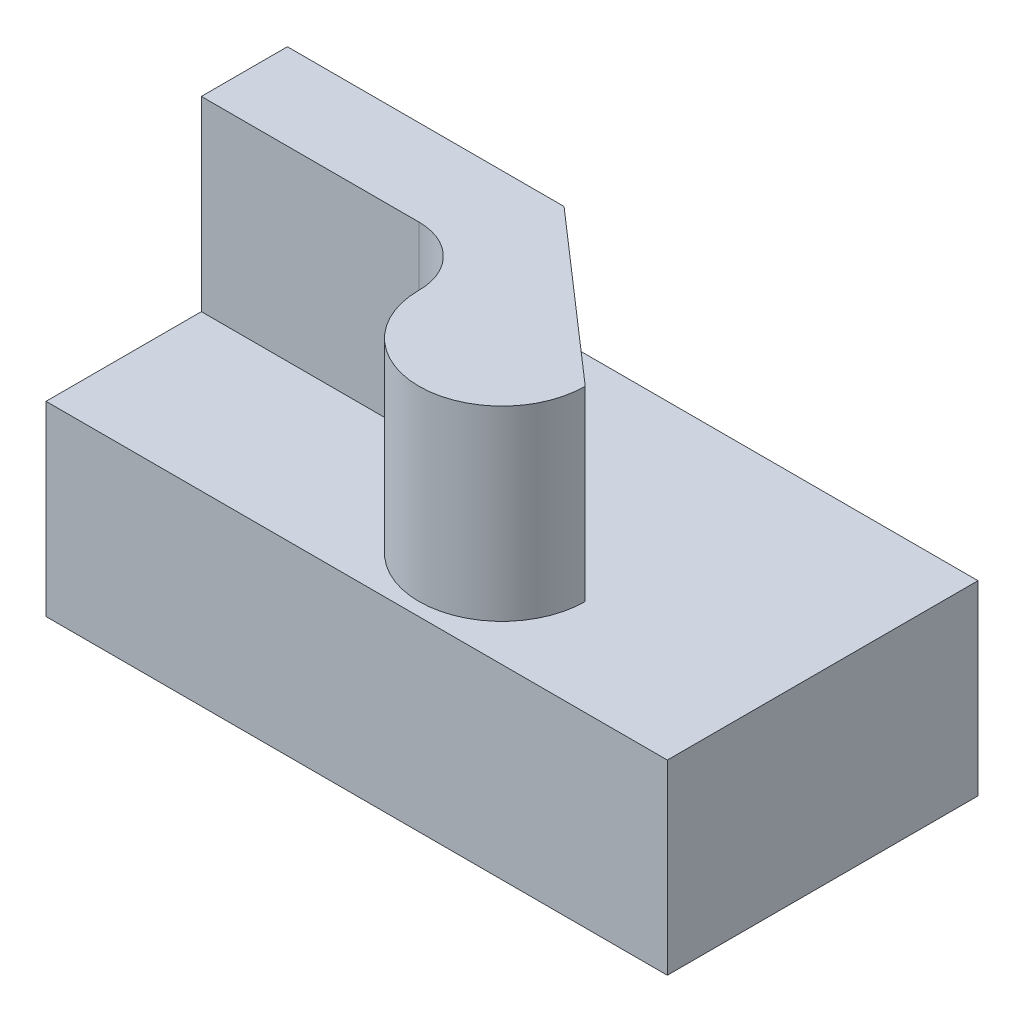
from build123d import *

# Parameters (mm, degrees)
SKETCH1_W      = 100
SKETCH1_H      = 50
EXTRUDE1_DEPTH = 30
EXTRUDE2_DEPTH = 30


with BuildPart() as part:
    # Sketch1 → Extrude1 (new body)
    with BuildSketch(Plane(origin=(0, 0, 0), x_dir=(1, 0, 0), z_dir=(0, 1, 0))):
        with Locations((50, 25)):
            Rectangle(SKETCH1_W, SKETCH1_H)
    extrude(amount=EXTRUDE1_DEPTH)

    # Sketch2 → Extrude2 (add)
    with BuildSketch(Plane(origin=(0, 30, 0), x_dir=(-1, 0, 0), z_dir=(0, 1, 0))):
        with BuildLine():
            Line((0, -25), (-35.020106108, -25))
            ThreePointArc((-35.020106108, -25), (-41.744261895, -22.214763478), (-44.529498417, -15.490607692))
            ThreePointArc((-44.529498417, -15.490607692), (-57.912069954, -2.108036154), (-71.294641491, -15.490607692))
            Line((-71.294641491, -15.490607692), (-44.529498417, -38.848671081))
            Line((-44.529498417, -38.848671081), (0, -38.848671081))
            Line((0, -38.848671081), (0, -25))
        make_face()
    extrude(amount=EXTRUDE2_DEPTH)


solid = part.part
